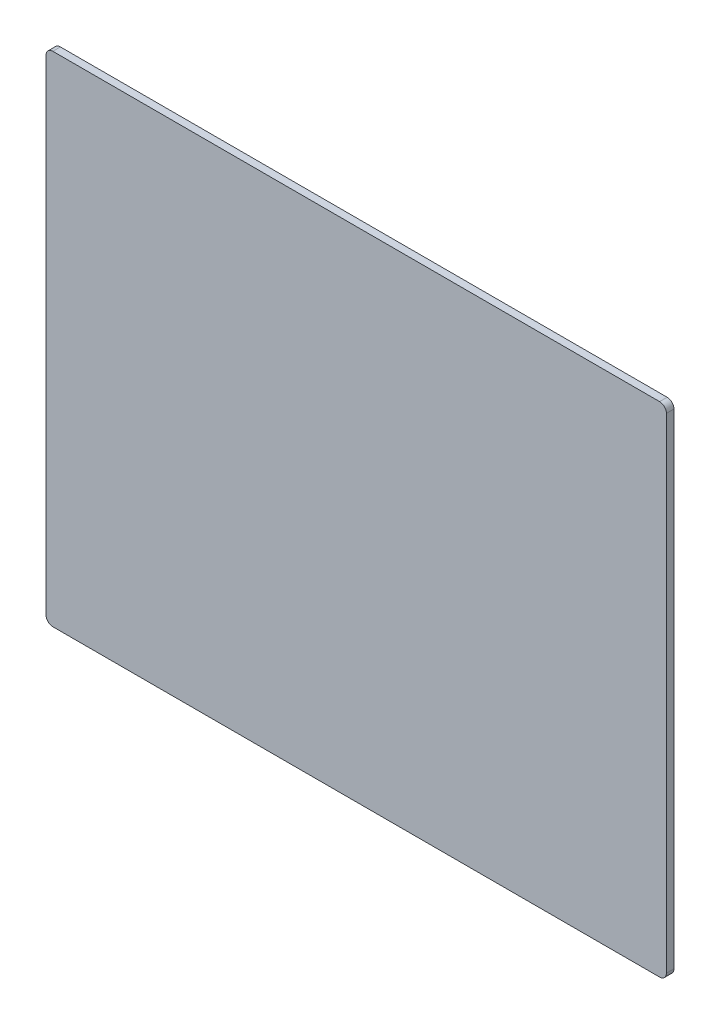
from build123d import *

# Parameters (mm, degrees)
BOSS_EXTRUDE1_DEPTH = 2.54


with BuildPart() as part:
    # Sketch1 → Boss-Extrude1 (new body)
    with BuildSketch(Plane.XY):
        with BuildLine():
            Line((502.550886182, 172.46092), (502.550886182, 9.54024))
            ThreePointArc((502.550886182, 9.54024), (501.881332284, 7.923793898), (500.264886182, 7.25424))
            Line((500.264886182, 7.25424), (296.343526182, 7.25424))
            ThreePointArc((296.343526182, 7.25424), (294.72708008, 7.923793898), (294.057526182, 9.54024))
            Line((294.057526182, 9.54024), (294.057526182, 172.46092))
            ThreePointArc((294.057526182, 172.46092), (294.72708008, 174.077366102), (296.343526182, 174.74692))
            Line((296.343526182, 174.74692), (500.264886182, 174.74692))
            ThreePointArc((500.264886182, 174.74692), (501.881332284, 174.077366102), (502.550886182, 172.46092))
        make_face()
    extrude(amount=BOSS_EXTRUDE1_DEPTH)


solid = part.part
